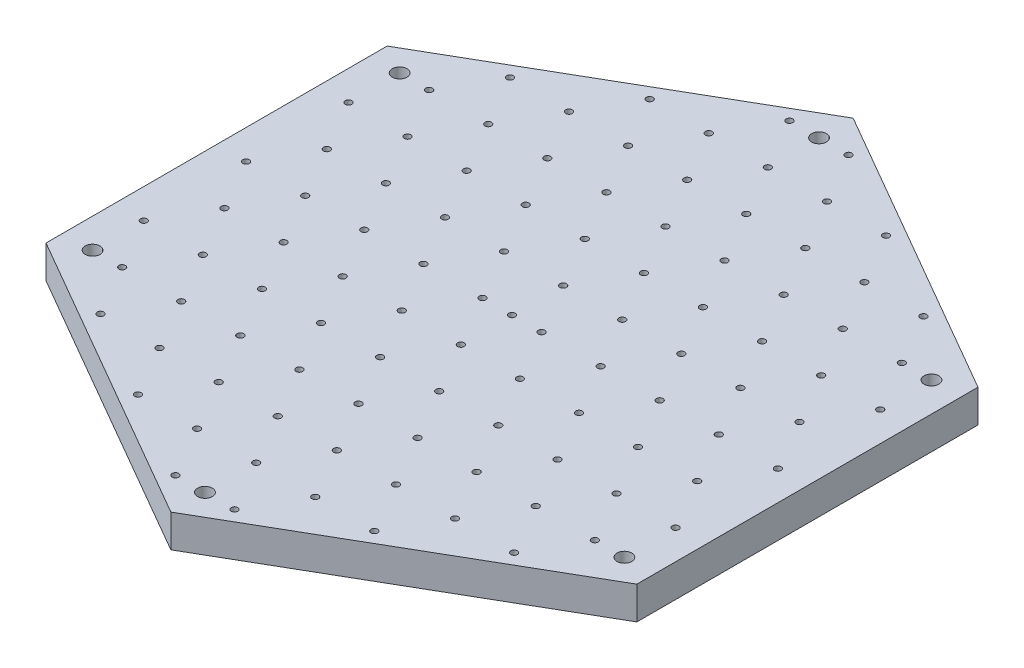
from build123d import *

# Parameters (mm, degrees)
BOSS_EXTRUDE1_DEPTH   = 6
SKETCH2_R             = 0.6
CUT_EXTRUDE1_DEPTH    = 83.897150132
BOSS_EXTRUDE2_DEPTH   = 0.5
BOSS_EXTRUDE3_DEPTH   = 0.5
BOSS_EXTRUDE4_DEPTH   = 0.5
SKETCH4_R             = 1.35
CUT_EXTRUDE3_DEPTH    = 83.897150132
SKETCH8_R             = 0.6
CUT_EXTRUDE4_DEPTH    = 83.897150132
SKETCH9_R             = 0.6
CUT_EXTRUDE5_DEPTH    = 83.897150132
SKETCH10_R            = 0.6
CUT_EXTRUDE6_DEPTH    = 83.897150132
SKETCH11_R            = 0.6
CUT_EXTRUDE7_DEPTH    = 83.897150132
SKETCH12_R            = 0.6
CUT_EXTRUDE8_DEPTH    = 83.897150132
SKETCH13_R            = 0.6
CUT_EXTRUDE9_DEPTH    = 83.897150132
SKETCH14_R            = 0.6
CUT_EXTRUDE10_DEPTH   = 83.897150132
SKETCH15_R            = 0.6
CUT_EXTRUDE11_DEPTH   = 83.897150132
SKETCH16_R            = 0.6
CUT_EXTRUDE12_DEPTH   = 83.897150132
SKETCH17_R            = 0.6
CUT_EXTRUDE13_DEPTH   = 83.897150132
LPATTERN3_COUNT       = 5
LPATTERN3_PITCH       = 10.8253
LPATTERN3_COL_COUNT   = 6
LPATTERN3_COL_PITCH   = 10.8253
LPATTERN4_COUNT       = 6
LPATTERN4_PITCH       = 10.8253
LPATTERN4_COL_COUNT   = 5
LPATTERN4_COL_PITCH   = 10.8253
LPATTERN5_COUNT       = 4
LPATTERN5_PITCH       = 10.8253
LPATTERN5_COL_COUNT   = 7
LPATTERN5_COL_PITCH   = 10.8253
LPATTERN6_COUNT       = 3
LPATTERN6_PITCH       = 10.8253
LPATTERN6_COL_COUNT   = 7
LPATTERN6_COL_PITCH   = 10.8253
LPATTERN7_COUNT       = 6
LPATTERN7_PITCH       = 10.8253
LPATTERN8_COUNT       = 5
LPATTERN8_PITCH       = 10.8253
LPATTERN9_COUNT       = 5
LPATTERN9_PITCH       = 10.8253
LPATTERN9_COL_COUNT   = 2
LPATTERN9_COL_PITCH   = 10.8253
LPATTERN10_COUNT      = 4
LPATTERN10_PITCH      = 10.8253
LPATTERN10_COL_COUNT  = 3
LPATTERN10_COL_PITCH  = 10.8253
LPATTERN11_COUNT      = 4
LPATTERN11_PITCH      = 10.8253
LPATTERN11_COL_COUNT  = 3
LPATTERN11_COL_PITCH  = 10.8253
LPATTERN12_COUNT      = 5
LPATTERN12_PITCH      = 10.8253
LPATTERN13_COUNT      = 6
LPATTERN13_PITCH      = 10.8253
LPATTERN14_COUNT      = 6
LPATTERN14_PITCH      = 10.8253
LPATTERN14_COUNT_DIR2 = 5
LPATTERN14_PITCH_DIR2 = 10.8253
LPATTERN15_COUNT      = 7
LPATTERN15_PITCH      = 10.8253
LPATTERN15_COUNT_DIR2 = 4
LPATTERN15_PITCH_DIR2 = 10.8253
LPATTERN16_COUNT      = 7
LPATTERN16_PITCH      = 10.8253
LPATTERN16_COUNT_DIR2 = 3
LPATTERN16_PITCH_DIR2 = 10.8253
LPATTERN17_COUNT      = 6
LPATTERN17_PITCH      = 10.8253
LPATTERN18_COUNT      = 5
LPATTERN18_PITCH      = 10.8253
LPATTERN19_COUNT      = 4
LPATTERN19_PITCH      = 10.8253
LPATTERN20_COUNT      = 3
LPATTERN20_PITCH      = 10.8253


with BuildPart() as part:
    # Sketch1 → Boss-Extrude1 (new body)
    with BuildSketch(Plane(origin=(0, 0, 0), x_dir=(1, 0, 0), z_dir=(0, 1, 0))):
        Polygon((0, 62.5), (-54.126587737, 31.25), (-54.126587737, -31.25), (0, -62.5), (54.126587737, -31.25), (54.126587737, 31.25), align=None)
    extrude(amount=BOSS_EXTRUDE1_DEPTH)

    # Sketch2 → Cut-Extrude1 (cut, through all)
    with BuildSketch(Plane(origin=(0, 6, 0), x_dir=(1, 0, 0), z_dir=(0, 1, 0))):
        with Locations(Location((0, 0, 0), (0, 0, 270))):
            Circle(SKETCH2_R)
    extrude(amount=-CUT_EXTRUDE1_DEPTH, mode=Mode.SUBTRACT)

    # Sketch5 → Boss-Extrude2 (add)
    with BuildSketch(Plane(origin=(0, 6, 0), x_dir=(1, 0, 0), z_dir=(0, 1, 0))):
        Polygon((-54.126587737, 26.862137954), (3.8, 60.306068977), (0, 62.5), (-54.126587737, 31.25), align=None)
    extrude(amount=-BOSS_EXTRUDE2_DEPTH)

    # Sketch6 → Boss-Extrude3 (add)
    with BuildSketch(Plane(origin=(0, 6, 0), x_dir=(1, 0, 0), z_dir=(0, 1, 0))):
        Polygon((54.126587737, 31.25), (54.126587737, 26.862137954), (-3.8, 60.306068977), (0, 62.5), align=None)
    extrude(amount=-BOSS_EXTRUDE3_DEPTH)

    # Sketch7 → Boss-Extrude4 (add)
    with BuildSketch(Plane(origin=(0, 6, 0), x_dir=(1, 0, 0), z_dir=(0, 1, 0))):
        Polygon((-54.126587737, -31.25), (-54.126587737, -26.862137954), (0, -58.112137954), (54.126587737, -26.862137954), (54.126587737, -31.25), (0, -62.5), align=None)
    extrude(amount=-BOSS_EXTRUDE4_DEPTH)

    # Sketch4 → Cut-Extrude3 (cut, through all)
    with BuildSketch(Plane(origin=(0, 6, 0), x_dir=(1, 0, 0), z_dir=(0, 1, 0))):
        with Locations(Location((0, 56.253070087, 0), (0, 0, 270))):
            Circle(SKETCH4_R)
        with Locations(Location((-48.713928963, 28.125, 0), (0, 0, 270))):
            Circle(SKETCH4_R)
        with Locations(Location((-48.716587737, -28.126535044, 0), (0, 0, 270))):
            Circle(SKETCH4_R)
        with Locations(Location((0, -56.253070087, 0), (0, 0, 270))):
            Circle(SKETCH4_R)
        with Locations(Location((48.716587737, -28.126535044, 0), (0, 0, 270))):
            Circle(SKETCH4_R)
        with Locations(Location((48.716587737, 28.126535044, 0), (0, 0, 270))):
            Circle(SKETCH4_R)
    extrude(amount=-CUT_EXTRUDE3_DEPTH, mode=Mode.SUBTRACT)

    # Sketch8 → Cut-Extrude4 (cut, through all)
    with BuildSketch(Plane(origin=(0, 6, 0), x_dir=(1, 0, 0), z_dir=(0, 1, 0))):
        with Locations(Location((5.41265, 0, 0), (0, 0, 270))):
            Circle(SKETCH8_R)
    cut_extrude4 = extrude(amount=-CUT_EXTRUDE4_DEPTH, mode=Mode.SUBTRACT)

    # Sketch9 → Cut-Extrude5 (cut, through all)
    with BuildSketch(Plane(origin=(0, 6, 0), x_dir=(1, 0, 0), z_dir=(0, 1, 0))):
        with Locations(Location((16.23795, 0, 0), (0, 0, 270))):
            Circle(SKETCH9_R)
    cut_extrude5 = extrude(amount=-CUT_EXTRUDE5_DEPTH, mode=Mode.SUBTRACT)

    # Sketch10 → Cut-Extrude6 (cut, through all)
    with BuildSketch(Plane(origin=(0, 6, 0), x_dir=(1, 0, 0), z_dir=(0, 1, 0))):
        with Locations(Location((27.06325, 0, 0), (0, 0, 270))):
            Circle(SKETCH10_R)
    cut_extrude6 = extrude(amount=-CUT_EXTRUDE6_DEPTH, mode=Mode.SUBTRACT)

    # Sketch11 → Cut-Extrude7 (cut, through all)
    with BuildSketch(Plane(origin=(0, 6, 0), x_dir=(1, 0, 0), z_dir=(0, 1, 0))):
        with Locations(Location((37.88855, 0, 0), (0, 0, 270))):
            Circle(SKETCH11_R)
    cut_extrude7 = extrude(amount=-CUT_EXTRUDE7_DEPTH, mode=Mode.SUBTRACT)

    # Sketch12 → Cut-Extrude8 (cut, through all)
    with BuildSketch(Plane(origin=(0, 6, 0), x_dir=(1, 0, 0), z_dir=(0, 1, 0))):
        with Locations(Location((48.71385, 0, 0), (0, 0, 270))):
            Circle(SKETCH12_R)
    cut_extrude8 = extrude(amount=-CUT_EXTRUDE8_DEPTH, mode=Mode.SUBTRACT)

    # Sketch13 → Cut-Extrude9 (cut, through all)
    with BuildSketch(Plane(origin=(0, 6, 0), x_dir=(1, 0, 0), z_dir=(0, 1, 0))):
        with Locations(Location((-5.41265, 0, 0), (0, 0, 270))):
            Circle(SKETCH13_R)
    cut_extrude9 = extrude(amount=-CUT_EXTRUDE9_DEPTH, mode=Mode.SUBTRACT)

    # Sketch14 → Cut-Extrude10 (cut, through all)
    with BuildSketch(Plane(origin=(0, 6, 0), x_dir=(1, 0, 0), z_dir=(0, 1, 0))):
        with Locations(Location((-16.23795, 0, 0), (0, 0, 270))):
            Circle(SKETCH14_R)
    cut_extrude10 = extrude(amount=-CUT_EXTRUDE10_DEPTH, mode=Mode.SUBTRACT)

    # Sketch15 → Cut-Extrude11 (cut, through all)
    with BuildSketch(Plane(origin=(0, 6, 0), x_dir=(1, 0, 0), z_dir=(0, 1, 0))):
        with Locations(Location((-27.06325, 0, 0), (0, 0, 270))):
            Circle(SKETCH15_R)
    cut_extrude11 = extrude(amount=-CUT_EXTRUDE11_DEPTH, mode=Mode.SUBTRACT)

    # Sketch16 → Cut-Extrude12 (cut, through all)
    with BuildSketch(Plane(origin=(0, 6, 0), x_dir=(1, 0, 0), z_dir=(0, 1, 0))):
        with Locations(Location((-37.88855, 0, 0), (0, 0, 270))):
            Circle(SKETCH16_R)
    cut_extrude12 = extrude(amount=-CUT_EXTRUDE12_DEPTH, mode=Mode.SUBTRACT)

    # Sketch17 → Cut-Extrude13 (cut, through all)
    with BuildSketch(Plane(origin=(0, 6, 0), x_dir=(1, 0, 0), z_dir=(0, 1, 0))):
        with Locations(Location((-48.71385, 0, 0), (0, 0, 270))):
            Circle(SKETCH17_R)
    cut_extrude13 = extrude(amount=-CUT_EXTRUDE13_DEPTH, mode=Mode.SUBTRACT)

    # LPattern3: Cut-Extrude4 ×5
    with Locations(*[Vector(0.4999999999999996, 0, 0.8660254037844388) * (i * LPATTERN3_PITCH) for i in range(1, LPATTERN3_COUNT)]):
        add(cut_extrude4, mode=Mode.SUBTRACT)

    # LPattern3 col: Cut-Extrude4 ×6
    with Locations(*[Vector(-0.4999999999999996, 0, -0.8660254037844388) * (i * LPATTERN3_COL_PITCH) for i in range(1, LPATTERN3_COL_COUNT)]):
        add(cut_extrude4, mode=Mode.SUBTRACT)

    # LPattern4: Cut-Extrude5 ×6
    with Locations(*[Vector(-0.4999999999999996, 0, -0.8660254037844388) * (i * LPATTERN4_PITCH) for i in range(1, LPATTERN4_COUNT)]):
        add(cut_extrude5, mode=Mode.SUBTRACT)

    # LPattern4 col: Cut-Extrude5 ×5
    with Locations(*[Vector(0.4999999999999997, 0, 0.8660254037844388) * (i * LPATTERN4_COL_PITCH) for i in range(1, LPATTERN4_COL_COUNT)]):
        add(cut_extrude5, mode=Mode.SUBTRACT)

    # LPattern5: Cut-Extrude6 ×4
    with Locations(*[Vector(0.4999999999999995, 0, 0.8660254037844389) * (i * LPATTERN5_PITCH) for i in range(1, LPATTERN5_COUNT)]):
        add(cut_extrude6, mode=Mode.SUBTRACT)

    # LPattern5 col: Cut-Extrude6 ×7
    with Locations(*[Vector(-0.4999999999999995, 0, -0.8660254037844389) * (i * LPATTERN5_COL_PITCH) for i in range(1, LPATTERN5_COL_COUNT)]):
        add(cut_extrude6, mode=Mode.SUBTRACT)

    # LPattern6: Cut-Extrude7 ×3
    with Locations(*[Vector(0.4999999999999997, 0, 0.8660254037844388) * (i * LPATTERN6_PITCH) for i in range(1, LPATTERN6_COUNT)]):
        add(cut_extrude7, mode=Mode.SUBTRACT)

    # LPattern6 col: Cut-Extrude7 ×7
    with Locations(*[Vector(-0.4999999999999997, 0, -0.8660254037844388) * (i * LPATTERN6_COL_PITCH) for i in range(1, LPATTERN6_COL_COUNT)]):
        add(cut_extrude7, mode=Mode.SUBTRACT)

    # LPattern7: Cut-Extrude8 ×6
    with Locations(*[Vector(-0.4999999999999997, 0, -0.8660254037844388) * (i * LPATTERN7_PITCH) for i in range(1, LPATTERN7_COUNT)]):
        add(cut_extrude8, mode=Mode.SUBTRACT)

    # LPattern8: Cut-Extrude9 ×5
    with Locations(*[Vector(-0.4999999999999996, 0, 0.8660254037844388) * (i * LPATTERN8_PITCH) for i in range(1, LPATTERN8_COUNT)]):
        add(cut_extrude9, mode=Mode.SUBTRACT)

    # LPattern9: Cut-Extrude10 ×5
    with Locations(*[Vector(-0.4999999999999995, 0, 0.8660254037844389) * (i * LPATTERN9_PITCH) for i in range(1, LPATTERN9_COUNT)]):
        add(cut_extrude10, mode=Mode.SUBTRACT)

    # LPattern9 col: Cut-Extrude10 ×2
    with Locations(*[Vector(0.4999999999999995, 0, -0.8660254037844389) * (i * LPATTERN9_COL_PITCH) for i in range(1, LPATTERN9_COL_COUNT)]):
        add(cut_extrude10, mode=Mode.SUBTRACT)

    # LPattern10: Cut-Extrude11 ×4
    with Locations(*[Vector(-0.4999999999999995, 0, 0.8660254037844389) * (i * LPATTERN10_PITCH) for i in range(1, LPATTERN10_COUNT)]):
        add(cut_extrude11, mode=Mode.SUBTRACT)

    # LPattern10 col: Cut-Extrude11 ×3
    with Locations(*[Vector(0.4999999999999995, 0, -0.8660254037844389) * (i * LPATTERN10_COL_PITCH) for i in range(1, LPATTERN10_COL_COUNT)]):
        add(cut_extrude11, mode=Mode.SUBTRACT)

    # LPattern11: Cut-Extrude12 ×4
    with Locations(*[Vector(0.4999999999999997, 0, -0.8660254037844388) * (i * LPATTERN11_PITCH) for i in range(1, LPATTERN11_COUNT)]):
        add(cut_extrude12, mode=Mode.SUBTRACT)

    # LPattern11 col: Cut-Extrude12 ×3
    with Locations(*[Vector(-0.4999999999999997, 0, 0.8660254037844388) * (i * LPATTERN11_COL_PITCH) for i in range(1, LPATTERN11_COL_COUNT)]):
        add(cut_extrude12, mode=Mode.SUBTRACT)

    # LPattern12: Cut-Extrude13 ×5
    with Locations(*[Vector(0.4999999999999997, 0, -0.8660254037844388) * (i * LPATTERN12_PITCH) for i in range(1, LPATTERN12_COUNT)]):
        add(cut_extrude13, mode=Mode.SUBTRACT)

    # LPattern13: Cut-Extrude9 ×6
    with Locations(*[Vector(0.4999999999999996, 0, 0.8660254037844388) * (i * LPATTERN13_PITCH) for i in range(1, LPATTERN13_COUNT)]):
        add(cut_extrude9, mode=Mode.SUBTRACT)

    # LPattern14: Cut-Extrude10 6 × 5
    with Locations(*[Vector(0.4999999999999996, 0, 0.8660254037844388) * (i * LPATTERN14_PITCH) + Vector(-0.4999999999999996, 0, -0.8660254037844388) * (j * LPATTERN14_PITCH_DIR2) for i in range(LPATTERN14_COUNT) for j in range(LPATTERN14_COUNT_DIR2) if (i, j) != (0, 0)]):
        add(cut_extrude10, mode=Mode.SUBTRACT)

    # LPattern15: Cut-Extrude11 7 × 4
    with Locations(*[Vector(0.4999999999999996, 0, 0.8660254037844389) * (i * LPATTERN15_PITCH) + Vector(-0.4999999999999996, 0, -0.8660254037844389) * (j * LPATTERN15_PITCH_DIR2) for i in range(LPATTERN15_COUNT) for j in range(LPATTERN15_COUNT_DIR2) if (i, j) != (0, 0)]):
        add(cut_extrude11, mode=Mode.SUBTRACT)

    # LPattern16: Cut-Extrude12 7 × 3
    with Locations(*[Vector(0.4999999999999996, 0, 0.8660254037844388) * (i * LPATTERN16_PITCH) + Vector(-0.4999999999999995, 0, -0.8660254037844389) * (j * LPATTERN16_PITCH_DIR2) for i in range(LPATTERN16_COUNT) for j in range(LPATTERN16_COUNT_DIR2) if (i, j) != (0, 0)]):
        add(cut_extrude12, mode=Mode.SUBTRACT)

    # LPattern17: Cut-Extrude13 ×6
    with Locations(*[Vector(0.49999999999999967, 0, 0.8660254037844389) * (i * LPATTERN17_PITCH) for i in range(1, LPATTERN17_COUNT)]):
        add(cut_extrude13, mode=Mode.SUBTRACT)

    # LPattern18: Cut-Extrude5 ×5
    with Locations(*[Vector(0.4999999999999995, 0, -0.8660254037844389) * (i * LPATTERN18_PITCH) for i in range(1, LPATTERN18_COUNT)]):
        add(cut_extrude5, mode=Mode.SUBTRACT)

    # LPattern19: Cut-Extrude6 ×4
    with Locations(*[Vector(0.4999999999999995, 0, -0.866025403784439) * (i * LPATTERN19_PITCH) for i in range(1, LPATTERN19_COUNT)]):
        add(cut_extrude6, mode=Mode.SUBTRACT)

    # LPattern20: Cut-Extrude7 ×3
    with Locations(*[Vector(0.4999999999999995, 0, -0.8660254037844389) * (i * LPATTERN20_PITCH) for i in range(1, LPATTERN20_COUNT)]):
        add(cut_extrude7, mode=Mode.SUBTRACT)


solid = part.part
